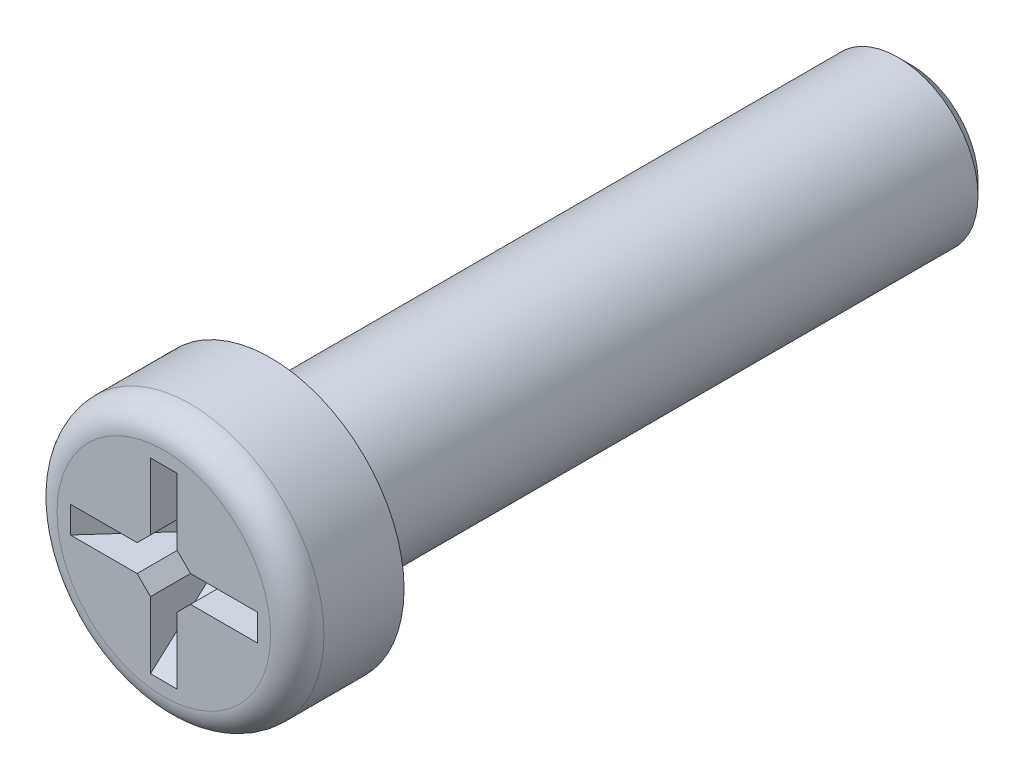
ISO-10303-21;
HEADER;
FILE_DESCRIPTION(('STEP AP214'),'2;1');
FILE_NAME('part.step','',(''),(''),'','','');
FILE_SCHEMA(('AUTOMOTIVE_DESIGN { 1 0 10303 214 1 1 1 1 }'));
ENDSEC;
DATA;
#1=APPLICATION_CONTEXT('core data for automotive mechanical design processes');
#2=APPLICATION_PROTOCOL_DEFINITION('international standard','automotive_design',2000,#1);
#3=PRODUCT_CONTEXT('',#1,'mechanical');
#4=PRODUCT('Part','Part','',(#3));
#5=PRODUCT_RELATED_PRODUCT_CATEGORY('part','',(#4));
#6=PRODUCT_DEFINITION_FORMATION('','',#4);
#7=PRODUCT_DEFINITION_CONTEXT('part definition',#1,'design');
#8=PRODUCT_DEFINITION('design','',#6,#7);
#9=PRODUCT_DEFINITION_SHAPE('','',#8);
#10=(LENGTH_UNIT() NAMED_UNIT(*) SI_UNIT(.MILLI.,.METRE.));
#11=(NAMED_UNIT(*) PLANE_ANGLE_UNIT() SI_UNIT($,.RADIAN.));
#12=(NAMED_UNIT(*) SI_UNIT($,.STERADIAN.) SOLID_ANGLE_UNIT());
#13=UNCERTAINTY_MEASURE_WITH_UNIT(LENGTH_MEASURE(1.E-05),#10,'distance_accuracy_value','');
#14=(GEOMETRIC_REPRESENTATION_CONTEXT(3) GLOBAL_UNCERTAINTY_ASSIGNED_CONTEXT((#13)) GLOBAL_UNIT_ASSIGNED_CONTEXT((#10,
#11,#12)) REPRESENTATION_CONTEXT('',''));
#15=CARTESIAN_POINT('',(0.,0.,0.));
#16=DIRECTION('',(0.,0.,1.));
#17=DIRECTION('',(1.,0.,0.));
#18=AXIS2_PLACEMENT_3D('',#15,#16,#17);
#19=CARTESIAN_POINT('',(1.75,0.25,2.));
#20=DIRECTION('',(-0.743144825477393,0.,0.669130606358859));
#21=DIRECTION('',(0.669130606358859,0.,0.743144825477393));
#22=AXIS2_PLACEMENT_3D('',#19,#20,#21);
#23=PLANE('',#22);
#24=DIRECTION('',(-0.669130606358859,0.,-0.743144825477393));
#25=VECTOR('',#24,1.);
#26=CARTESIAN_POINT('',(1.75,0.25,2.));
#27=LINE('',#26,#25);
#28=CARTESIAN_POINT('',(0.500000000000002,0.249999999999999,0.611734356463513));
#29=VERTEX_POINT('',#28);
#30=CARTESIAN_POINT('',(1.75,0.25,2.));
#31=VERTEX_POINT('',#30);
#32=EDGE_CURVE('E223',#29,#31,#27,.F.);
#33=ORIENTED_EDGE('',*,*,#32,.F.);
#34=DIRECTION('',(-0.556117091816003,0.556117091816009,-0.617630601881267));
#35=VECTOR('',#34,1.);
#36=CARTESIAN_POINT('',(1.36341722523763,-0.61341722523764,1.57065633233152));
#37=LINE('',#36,#35);
#38=CARTESIAN_POINT('',(0.375000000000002,0.375,0.472907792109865));
#39=VERTEX_POINT('',#38);
#40=EDGE_CURVE('E270',#29,#39,#37,.T.);
#41=ORIENTED_EDGE('',*,*,#40,.T.);
#42=DIRECTION('',(-0.556117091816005,-0.556117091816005,-0.617630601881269));
#43=VECTOR('',#42,1.);
#44=CARTESIAN_POINT('',(1.13146756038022,1.13146756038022,1.31305013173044));
#45=LINE('',#44,#43);
#46=CARTESIAN_POINT('',(0.0392323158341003,0.0392323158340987,0.1));
#47=VERTEX_POINT('',#46);
#48=EDGE_CURVE('E242',#39,#47,#45,.T.);
#49=ORIENTED_EDGE('',*,*,#48,.T.);
#50=DIRECTION('',(0.,-1.,0.));
#51=VECTOR('',#50,1.);
#52=CARTESIAN_POINT('',(0.0392323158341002,-0.249999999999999,0.1));
#53=LINE('',#52,#51);
#54=CARTESIAN_POINT('',(0.0392323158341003,-0.0392323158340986,0.1));
#55=VERTEX_POINT('',#54);
#56=EDGE_CURVE('E226',#55,#47,#53,.F.);
#57=ORIENTED_EDGE('',*,*,#56,.F.);
#58=DIRECTION('',(-0.556117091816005,0.556117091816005,-0.617630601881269));
#59=VECTOR('',#58,1.);
#60=CARTESIAN_POINT('',(1.13146756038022,-1.13146756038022,1.31305013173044));
#61=LINE('',#60,#59);
#62=CARTESIAN_POINT('',(0.375000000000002,-0.375,0.472907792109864));
#63=VERTEX_POINT('',#62);
#64=EDGE_CURVE('E57',#63,#55,#61,.T.);
#65=ORIENTED_EDGE('',*,*,#64,.F.);
#66=DIRECTION('',(0.556117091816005,0.556117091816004,0.617630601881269));
#67=VECTOR('',#66,1.);
#68=CARTESIAN_POINT('',(1.51805033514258,0.768050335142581,1.74239379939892));
#69=LINE('',#68,#67);
#70=CARTESIAN_POINT('',(0.500000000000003,-0.249999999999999,0.611734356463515));
#71=VERTEX_POINT('',#70);
#72=EDGE_CURVE('E281',#63,#71,#69,.T.);
#73=ORIENTED_EDGE('',*,*,#72,.T.);
#74=DIRECTION('',(-0.669130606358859,0.,-0.743144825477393));
#75=VECTOR('',#74,1.);
#76=CARTESIAN_POINT('',(0.133600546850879,-0.249999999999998,0.204806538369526));
#77=LINE('',#76,#75);
#78=CARTESIAN_POINT('',(1.75,-0.25,2.));
#79=VERTEX_POINT('',#78);
#80=EDGE_CURVE('E228',#71,#79,#77,.F.);
#81=ORIENTED_EDGE('',*,*,#80,.T.);
#82=DIRECTION('',(0.,1.,0.));
#83=VECTOR('',#82,1.);
#84=CARTESIAN_POINT('',(1.75,0.25,2.));
#85=LINE('',#84,#83);
#86=EDGE_CURVE('E190',#79,#31,#85,.T.);
#87=ORIENTED_EDGE('',*,*,#86,.T.);
#88=EDGE_LOOP('',(#33,#41,#49,#57,#65,#73,#81,#87));
#89=FACE_BOUND('',#88,.T.);
#90=ADVANCED_FACE('F34',(#89),#23,.T.);
#91=CARTESIAN_POINT('',(-0.250000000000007,1.75,2.));
#92=DIRECTION('',(0.,-0.743144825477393,0.669130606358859));
#93=DIRECTION('',(0.,-0.669130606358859,-0.743144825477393));
#94=AXIS2_PLACEMENT_3D('',#91,#92,#93);
#95=PLANE('',#94);
#96=ORIENTED_EDGE('',*,*,#48,.F.);
#97=DIRECTION('',(-0.556117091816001,0.556117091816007,0.61763060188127));
#98=VECTOR('',#97,1.);
#99=CARTESIAN_POINT('',(-0.768050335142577,1.51805033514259,1.74239379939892));
#100=LINE('',#99,#98);
#101=CARTESIAN_POINT('',(0.250000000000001,0.500000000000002,0.611734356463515));
#102=VERTEX_POINT('',#101);
#103=EDGE_CURVE('E273',#39,#102,#100,.T.);
#104=ORIENTED_EDGE('',*,*,#103,.T.);
#105=DIRECTION('',(0.,-0.669130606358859,-0.743144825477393));
#106=VECTOR('',#105,1.);
#107=CARTESIAN_POINT('',(0.250000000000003,0.80520419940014,0.950697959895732));
#108=LINE('',#107,#106);
#109=CARTESIAN_POINT('',(0.250000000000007,1.75,2.));
#110=VERTEX_POINT('',#109);
#111=EDGE_CURVE('E221',#102,#110,#108,.F.);
#112=ORIENTED_EDGE('',*,*,#111,.T.);
#113=DIRECTION('',(-1.,0.,0.));
#114=VECTOR('',#113,1.);
#115=CARTESIAN_POINT('',(-0.250000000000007,1.75,2.));
#116=LINE('',#115,#114);
#117=CARTESIAN_POINT('',(-0.250000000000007,1.75,2.));
#118=VERTEX_POINT('',#117);
#119=EDGE_CURVE('E199',#110,#118,#116,.T.);
#120=ORIENTED_EDGE('',*,*,#119,.T.);
#121=DIRECTION('',(0.,-0.669130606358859,-0.743144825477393));
#122=VECTOR('',#121,1.);
#123=CARTESIAN_POINT('',(-0.250000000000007,1.75,2.));
#124=LINE('',#123,#122);
#125=CARTESIAN_POINT('',(-0.250000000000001,0.5,0.611734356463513));
#126=VERTEX_POINT('',#125);
#127=EDGE_CURVE('E207',#126,#118,#124,.F.);
#128=ORIENTED_EDGE('',*,*,#127,.F.);
#129=DIRECTION('',(-0.556117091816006,-0.556117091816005,-0.617630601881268));
#130=VECTOR('',#129,1.);
#131=CARTESIAN_POINT('',(0.613417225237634,1.36341722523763,1.57065633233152));
#132=LINE('',#131,#130);
#133=CARTESIAN_POINT('',(-0.375000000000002,0.375,0.472907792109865));
#134=VERTEX_POINT('',#133);
#135=EDGE_CURVE('E275',#126,#134,#132,.T.);
#136=ORIENTED_EDGE('',*,*,#135,.T.);
#137=DIRECTION('',(0.556117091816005,-0.556117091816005,-0.617630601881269));
#138=VECTOR('',#137,1.);
#139=CARTESIAN_POINT('',(-1.28610067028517,1.28610067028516,1.48478759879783));
#140=LINE('',#139,#138);
#141=CARTESIAN_POINT('',(-0.0392323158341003,0.0392323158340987,0.1));
#142=VERTEX_POINT('',#141);
#143=EDGE_CURVE('E239',#134,#142,#140,.T.);
#144=ORIENTED_EDGE('',*,*,#143,.T.);
#145=DIRECTION('',(1.,0.,0.));
#146=VECTOR('',#145,1.);
#147=CARTESIAN_POINT('',(-0.249999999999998,0.0392323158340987,0.1));
#148=LINE('',#147,#146);
#149=EDGE_CURVE('E160',#47,#142,#148,.F.);
#150=ORIENTED_EDGE('',*,*,#149,.F.);
#151=EDGE_LOOP('',(#96,#104,#112,#120,#128,#136,#144,#150));
#152=FACE_BOUND('',#151,.T.);
#153=ADVANCED_FACE('F36',(#152),#95,.T.);
#154=CARTESIAN_POINT('',(-0.250000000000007,-1.75,2.));
#155=DIRECTION('',(0.,0.743144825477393,0.669130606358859));
#156=DIRECTION('',(0.,-0.669130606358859,0.743144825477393));
#157=AXIS2_PLACEMENT_3D('',#154,#155,#156);
#158=PLANE('',#157);
#159=DIRECTION('',(0.,0.669130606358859,-0.743144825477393));
#160=VECTOR('',#159,1.);
#161=CARTESIAN_POINT('',(0.250000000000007,-1.75,2.));
#162=LINE('',#161,#160);
#163=CARTESIAN_POINT('',(0.250000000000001,-0.5,0.611734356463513));
#164=VERTEX_POINT('',#163);
#165=CARTESIAN_POINT('',(0.250000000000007,-1.75,2.));
#166=VERTEX_POINT('',#165);
#167=EDGE_CURVE('E230',#164,#166,#162,.F.);
#168=ORIENTED_EDGE('',*,*,#167,.F.);
#169=DIRECTION('',(0.556117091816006,0.556117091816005,-0.617630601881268));
#170=VECTOR('',#169,1.);
#171=CARTESIAN_POINT('',(-0.768050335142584,-1.51805033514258,1.74239379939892));
#172=LINE('',#171,#170);
#173=EDGE_CURVE('E279',#164,#63,#172,.T.);
#174=ORIENTED_EDGE('',*,*,#173,.T.);
#175=ORIENTED_EDGE('',*,*,#64,.T.);
#176=DIRECTION('',(-1.,0.,0.));
#177=VECTOR('',#176,1.);
#178=CARTESIAN_POINT('',(-0.249999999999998,-0.0392323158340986,0.1));
#179=LINE('',#178,#177);
#180=CARTESIAN_POINT('',(-0.0392323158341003,-0.0392323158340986,0.1));
#181=VERTEX_POINT('',#180);
#182=EDGE_CURVE('E218',#181,#55,#179,.F.);
#183=ORIENTED_EDGE('',*,*,#182,.F.);
#184=DIRECTION('',(0.556117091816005,0.556117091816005,-0.617630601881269));
#185=VECTOR('',#184,1.);
#186=CARTESIAN_POINT('',(-1.28610067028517,-1.28610067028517,1.48478759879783));
#187=LINE('',#186,#185);
#188=CARTESIAN_POINT('',(-0.375000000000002,-0.375,0.472907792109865));
#189=VERTEX_POINT('',#188);
#190=EDGE_CURVE('E49',#189,#181,#187,.T.);
#191=ORIENTED_EDGE('',*,*,#190,.F.);
#192=DIRECTION('',(0.556117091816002,-0.556117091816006,0.61763060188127));
#193=VECTOR('',#192,1.);
#194=CARTESIAN_POINT('',(0.61341722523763,-1.36341722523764,1.57065633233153));
#195=LINE('',#194,#193);
#196=CARTESIAN_POINT('',(-0.250000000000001,-0.500000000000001,0.611734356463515));
#197=VERTEX_POINT('',#196);
#198=EDGE_CURVE('E285',#189,#197,#195,.T.);
#199=ORIENTED_EDGE('',*,*,#198,.T.);
#200=DIRECTION('',(0.,0.669130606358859,-0.743144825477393));
#201=VECTOR('',#200,1.);
#202=CARTESIAN_POINT('',(-0.25,-0.133600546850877,0.204806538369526));
#203=LINE('',#202,#201);
#204=CARTESIAN_POINT('',(-0.250000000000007,-1.75,2.));
#205=VERTEX_POINT('',#204);
#206=EDGE_CURVE('E220',#197,#205,#203,.F.);
#207=ORIENTED_EDGE('',*,*,#206,.T.);
#208=DIRECTION('',(1.,0.,0.));
#209=VECTOR('',#208,1.);
#210=CARTESIAN_POINT('',(-0.250000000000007,-1.75,2.));
#211=LINE('',#210,#209);
#212=EDGE_CURVE('E181',#205,#166,#211,.T.);
#213=ORIENTED_EDGE('',*,*,#212,.T.);
#214=EDGE_LOOP('',(#168,#174,#175,#183,#191,#199,#207,#213));
#215=FACE_BOUND('',#214,.T.);
#216=ADVANCED_FACE('F307',(#215),#158,.T.);
#217=CARTESIAN_POINT('',(-1.75,0.25,2.));
#218=DIRECTION('',(0.743144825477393,0.,0.669130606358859));
#219=DIRECTION('',(0.669130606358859,0.,-0.743144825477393));
#220=AXIS2_PLACEMENT_3D('',#217,#218,#219);
#221=PLANE('',#220);
#222=ORIENTED_EDGE('',*,*,#143,.F.);
#223=DIRECTION('',(-0.556117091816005,-0.556117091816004,0.617630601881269));
#224=VECTOR('',#223,1.);
#225=CARTESIAN_POINT('',(-1.36341722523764,-0.613417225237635,1.57065633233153));
#226=LINE('',#225,#224);
#227=CARTESIAN_POINT('',(-0.500000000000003,0.249999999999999,0.611734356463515));
#228=VERTEX_POINT('',#227);
#229=EDGE_CURVE('E155',#134,#228,#226,.T.);
#230=ORIENTED_EDGE('',*,*,#229,.T.);
#231=DIRECTION('',(0.669130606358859,0.,-0.743144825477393));
#232=VECTOR('',#231,1.);
#233=CARTESIAN_POINT('',(-0.805204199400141,0.249999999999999,0.950697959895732));
#234=LINE('',#233,#232);
#235=CARTESIAN_POINT('',(-1.75,0.25,2.));
#236=VERTEX_POINT('',#235);
#237=EDGE_CURVE('E147',#228,#236,#234,.F.);
#238=ORIENTED_EDGE('',*,*,#237,.T.);
#239=DIRECTION('',(0.,-1.,0.));
#240=VECTOR('',#239,1.);
#241=CARTESIAN_POINT('',(-1.75,0.25,2.));
#242=LINE('',#241,#240);
#243=CARTESIAN_POINT('',(-1.75,-0.25,2.));
#244=VERTEX_POINT('',#243);
#245=EDGE_CURVE('E152',#236,#244,#242,.T.);
#246=ORIENTED_EDGE('',*,*,#245,.T.);
#247=DIRECTION('',(0.669130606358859,0.,-0.743144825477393));
#248=VECTOR('',#247,1.);
#249=CARTESIAN_POINT('',(-1.75,-0.25,2.));
#250=LINE('',#249,#248);
#251=CARTESIAN_POINT('',(-0.500000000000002,-0.249999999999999,0.611734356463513));
#252=VERTEX_POINT('',#251);
#253=EDGE_CURVE('E159',#252,#244,#250,.F.);
#254=ORIENTED_EDGE('',*,*,#253,.F.);
#255=DIRECTION('',(0.556117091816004,-0.556117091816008,-0.617630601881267));
#256=VECTOR('',#255,1.);
#257=CARTESIAN_POINT('',(-1.51805033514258,0.768050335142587,1.74239379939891));
#258=LINE('',#257,#256);
#259=EDGE_CURVE('E283',#252,#189,#258,.T.);
#260=ORIENTED_EDGE('',*,*,#259,.T.);
#261=ORIENTED_EDGE('',*,*,#190,.T.);
#262=DIRECTION('',(0.,1.,0.));
#263=VECTOR('',#262,1.);
#264=CARTESIAN_POINT('',(-0.0392323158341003,-0.249999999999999,0.1));
#265=LINE('',#264,#263);
#266=EDGE_CURVE('E202',#142,#181,#265,.F.);
#267=ORIENTED_EDGE('',*,*,#266,.F.);
#268=EDGE_LOOP('',(#222,#230,#238,#246,#254,#260,#261,#267));
#269=FACE_BOUND('',#268,.T.);
#270=ADVANCED_FACE('F149',(#269),#221,.T.);
#271=CARTESIAN_POINT('',(0.,0.,0.));
#272=DIRECTION('',(0.,0.,1.));
#273=DIRECTION('',(1.,0.,0.));
#274=AXIS2_PLACEMENT_3D('',#271,#272,#273);
#275=PLANE('',#274);
#276=CARTESIAN_POINT('',(0.,0.,0.));
#277=DIRECTION('',(0.,0.,1.));
#278=DIRECTION('',(1.,0.,0.));
#279=AXIS2_PLACEMENT_3D('',#276,#277,#278);
#280=CIRCLE('',#279,2.5);
#281=CARTESIAN_POINT('',(2.5,0.,0.));
#282=VERTEX_POINT('',#281);
#283=EDGE_CURVE('E203',#282,#282,#280,.T.);
#284=ORIENTED_EDGE('',*,*,#283,.F.);
#285=EDGE_LOOP('',(#284));
#286=FACE_BOUND('',#285,.T.);
#287=CARTESIAN_POINT('',(0.,0.,0.));
#288=DIRECTION('',(0.,0.,1.));
#289=DIRECTION('',(1.,0.,0.));
#290=AXIS2_PLACEMENT_3D('',#287,#288,#289);
#291=CIRCLE('',#290,1.5);
#292=CARTESIAN_POINT('',(1.5,0.,0.));
#293=VERTEX_POINT('',#292);
#294=EDGE_CURVE('E206',#293,#293,#291,.F.);
#295=ORIENTED_EDGE('',*,*,#294,.F.);
#296=EDGE_LOOP('',(#295));
#297=FACE_BOUND('',#296,.T.);
#298=ADVANCED_FACE('F315',(#286,#297),#275,.F.);
#299=CARTESIAN_POINT('',(0.,0.,2.));
#300=DIRECTION('',(0.,0.,-1.));
#301=DIRECTION('',(-1.,0.,0.));
#302=AXIS2_PLACEMENT_3D('',#299,#300,#301);
#303=CYLINDRICAL_SURFACE('',#302,2.5);
#304=CARTESIAN_POINT('',(0.,0.,1.5));
#305=DIRECTION('',(0.,0.,1.));
#306=DIRECTION('',(1.,0.,0.));
#307=AXIS2_PLACEMENT_3D('',#304,#305,#306);
#308=CIRCLE('',#307,2.5);
#309=CARTESIAN_POINT('',(2.5,0.,1.5));
#310=VERTEX_POINT('',#309);
#311=EDGE_CURVE('E213',#310,#310,#308,.F.);
#312=ORIENTED_EDGE('',*,*,#311,.T.);
#313=EDGE_LOOP('',(#312));
#314=FACE_BOUND('',#313,.T.);
#315=ORIENTED_EDGE('',*,*,#283,.T.);
#316=EDGE_LOOP('',(#315));
#317=FACE_BOUND('',#316,.T.);
#318=ADVANCED_FACE('F316',(#314,#317),#303,.T.);
#319=CARTESIAN_POINT('',(0.,0.,2.));
#320=DIRECTION('',(0.,0.,1.));
#321=DIRECTION('',(1.,0.,0.));
#322=AXIS2_PLACEMENT_3D('',#319,#320,#321);
#323=PLANE('',#322);
#324=DIRECTION('',(0.,1.,0.));
#325=VECTOR('',#324,1.);
#326=CARTESIAN_POINT('',(0.250000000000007,1.75,2.));
#327=LINE('',#326,#325);
#328=CARTESIAN_POINT('',(0.250000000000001,0.500000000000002,2.));
#329=VERTEX_POINT('',#328);
#330=EDGE_CURVE('E196',#329,#110,#327,.T.);
#331=ORIENTED_EDGE('',*,*,#330,.F.);
#332=DIRECTION('',(-0.707106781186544,0.707106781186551,0.));
#333=VECTOR('',#332,1.);
#334=CARTESIAN_POINT('',(0.375000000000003,0.374999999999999,2.));
#335=LINE('',#334,#333);
#336=CARTESIAN_POINT('',(0.500000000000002,0.249999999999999,2.));
#337=VERTEX_POINT('',#336);
#338=EDGE_CURVE('E253',#329,#337,#335,.F.);
#339=ORIENTED_EDGE('',*,*,#338,.T.);
#340=DIRECTION('',(-1.,0.,0.));
#341=VECTOR('',#340,1.);
#342=CARTESIAN_POINT('',(0.25,0.249999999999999,2.));
#343=LINE('',#342,#341);
#344=EDGE_CURVE('E193',#31,#337,#343,.T.);
#345=ORIENTED_EDGE('',*,*,#344,.F.);
#346=ORIENTED_EDGE('',*,*,#86,.F.);
#347=DIRECTION('',(1.,0.,0.));
#348=VECTOR('',#347,1.);
#349=CARTESIAN_POINT('',(0.25,-0.249999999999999,2.));
#350=LINE('',#349,#348);
#351=CARTESIAN_POINT('',(0.500000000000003,-0.249999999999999,2.));
#352=VERTEX_POINT('',#351);
#353=EDGE_CURVE('E187',#352,#79,#350,.T.);
#354=ORIENTED_EDGE('',*,*,#353,.F.);
#355=DIRECTION('',(0.707106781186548,0.707106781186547,0.));
#356=VECTOR('',#355,1.);
#357=CARTESIAN_POINT('',(0.375,-0.375000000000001,2.));
#358=LINE('',#357,#356);
#359=CARTESIAN_POINT('',(0.250000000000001,-0.5,2.));
#360=VERTEX_POINT('',#359);
#361=EDGE_CURVE('E249',#352,#360,#358,.F.);
#362=ORIENTED_EDGE('',*,*,#361,.T.);
#363=DIRECTION('',(0.,1.,0.));
#364=VECTOR('',#363,1.);
#365=CARTESIAN_POINT('',(0.25,-0.249999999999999,2.));
#366=LINE('',#365,#364);
#367=EDGE_CURVE('E184',#166,#360,#366,.T.);
#368=ORIENTED_EDGE('',*,*,#367,.F.);
#369=ORIENTED_EDGE('',*,*,#212,.F.);
#370=DIRECTION('',(0.,-1.,0.));
#371=VECTOR('',#370,1.);
#372=CARTESIAN_POINT('',(-0.25,-0.249999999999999,2.));
#373=LINE('',#372,#371);
#374=CARTESIAN_POINT('',(-0.250000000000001,-0.500000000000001,2.));
#375=VERTEX_POINT('',#374);
#376=EDGE_CURVE('E175',#375,#205,#373,.T.);
#377=ORIENTED_EDGE('',*,*,#376,.F.);
#378=DIRECTION('',(0.707106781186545,-0.70710678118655,0.));
#379=VECTOR('',#378,1.);
#380=CARTESIAN_POINT('',(-0.375000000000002,-0.374999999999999,2.));
#381=LINE('',#380,#379);
#382=CARTESIAN_POINT('',(-0.500000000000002,-0.249999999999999,2.));
#383=VERTEX_POINT('',#382);
#384=EDGE_CURVE('E247',#375,#383,#381,.F.);
#385=ORIENTED_EDGE('',*,*,#384,.T.);
#386=DIRECTION('',(1.,0.,0.));
#387=VECTOR('',#386,1.);
#388=CARTESIAN_POINT('',(-1.75,-0.25,2.));
#389=LINE('',#388,#387);
#390=EDGE_CURVE('E173',#244,#383,#389,.T.);
#391=ORIENTED_EDGE('',*,*,#390,.F.);
#392=ORIENTED_EDGE('',*,*,#245,.F.);
#393=DIRECTION('',(-1.,0.,0.));
#394=VECTOR('',#393,1.);
#395=CARTESIAN_POINT('',(-1.75,0.25,2.));
#396=LINE('',#395,#394);
#397=CARTESIAN_POINT('',(-0.500000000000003,0.249999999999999,2.));
#398=VERTEX_POINT('',#397);
#399=EDGE_CURVE('E163',#398,#236,#396,.T.);
#400=ORIENTED_EDGE('',*,*,#399,.F.);
#401=DIRECTION('',(-0.707106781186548,-0.707106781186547,0.));
#402=VECTOR('',#401,1.);
#403=CARTESIAN_POINT('',(-0.375000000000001,0.375000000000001,2.));
#404=LINE('',#403,#402);
#405=CARTESIAN_POINT('',(-0.250000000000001,0.5,2.));
#406=VERTEX_POINT('',#405);
#407=EDGE_CURVE('E251',#398,#406,#404,.F.);
#408=ORIENTED_EDGE('',*,*,#407,.T.);
#409=DIRECTION('',(0.,-1.,0.));
#410=VECTOR('',#409,1.);
#411=CARTESIAN_POINT('',(-0.250000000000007,1.75,2.));
#412=LINE('',#411,#410);
#413=EDGE_CURVE('E167',#118,#406,#412,.T.);
#414=ORIENTED_EDGE('',*,*,#413,.F.);
#415=ORIENTED_EDGE('',*,*,#119,.F.);
#416=EDGE_LOOP('',(#331,#339,#345,#346,#354,#362,#368,#369,#377,#385,#391,#392,#400,#408,#414,#415));
#417=FACE_BOUND('',#416,.T.);
#418=CARTESIAN_POINT('',(0.,0.,2.));
#419=DIRECTION('',(0.,0.,1.));
#420=DIRECTION('',(1.,0.,0.));
#421=AXIS2_PLACEMENT_3D('',#418,#419,#420);
#422=CIRCLE('',#421,2.);
#423=CARTESIAN_POINT('',(2.,0.,2.));
#424=VERTEX_POINT('',#423);
#425=EDGE_CURVE('E210',#424,#424,#422,.T.);
#426=ORIENTED_EDGE('',*,*,#425,.T.);
#427=EDGE_LOOP('',(#426));
#428=FACE_BOUND('',#427,.T.);
#429=ADVANCED_FACE('F170',(#417,#428),#323,.T.);
#430=CARTESIAN_POINT('',(0.,0.,-12.));
#431=DIRECTION('',(0.,0.,1.));
#432=DIRECTION('',(1.,0.,0.));
#433=AXIS2_PLACEMENT_3D('',#430,#431,#432);
#434=CYLINDRICAL_SURFACE('',#433,1.5);
#435=CARTESIAN_POINT('',(0.,0.,-11.75));
#436=DIRECTION('',(0.,0.,-1.));
#437=DIRECTION('',(-1.,0.,0.));
#438=AXIS2_PLACEMENT_3D('',#435,#436,#437);
#439=CIRCLE('',#438,1.5);
#440=CARTESIAN_POINT('',(-1.5,0.,-11.75));
#441=VERTEX_POINT('',#440);
#442=EDGE_CURVE('E11',#441,#441,#439,.F.);
#443=ORIENTED_EDGE('',*,*,#442,.T.);
#444=EDGE_LOOP('',(#443));
#445=FACE_BOUND('',#444,.T.);
#446=ORIENTED_EDGE('',*,*,#294,.T.);
#447=EDGE_LOOP('',(#446));
#448=FACE_BOUND('',#447,.T.);
#449=ADVANCED_FACE('F322',(#445,#448),#434,.T.);
#450=CARTESIAN_POINT('',(0.,0.,-12.));
#451=DIRECTION('',(0.,0.,-1.));
#452=DIRECTION('',(-1.,0.,0.));
#453=AXIS2_PLACEMENT_3D('',#450,#451,#452);
#454=PLANE('',#453);
#455=CARTESIAN_POINT('',(0.,0.,-12.));
#456=DIRECTION('',(0.,0.,-1.));
#457=DIRECTION('',(-1.,0.,0.));
#458=AXIS2_PLACEMENT_3D('',#455,#456,#457);
#459=CIRCLE('',#458,1.25);
#460=CARTESIAN_POINT('',(-1.25,0.,-12.));
#461=VERTEX_POINT('',#460);
#462=EDGE_CURVE('E42',#461,#461,#459,.T.);
#463=ORIENTED_EDGE('',*,*,#462,.T.);
#464=EDGE_LOOP('',(#463));
#465=FACE_BOUND('',#464,.T.);
#466=ADVANCED_FACE('F289',(#465),#454,.T.);
#467=CARTESIAN_POINT('',(0.,0.,1.5));
#468=DIRECTION('',(0.,0.,1.));
#469=DIRECTION('',(1.,0.,0.));
#470=AXIS2_PLACEMENT_3D('',#467,#468,#469);
#471=TOROIDAL_SURFACE('',#470,2.,0.5);
#472=ORIENTED_EDGE('',*,*,#311,.F.);
#473=EDGE_LOOP('',(#472));
#474=FACE_BOUND('',#473,.T.);
#475=ORIENTED_EDGE('',*,*,#425,.F.);
#476=EDGE_LOOP('',(#475));
#477=FACE_BOUND('',#476,.T.);
#478=ADVANCED_FACE('F331',(#474,#477),#471,.T.);
#479=CARTESIAN_POINT('',(-0.250000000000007,1.75,0.1));
#480=DIRECTION('',(-1.,0.,0.));
#481=DIRECTION('',(0.,-1.,0.));
#482=AXIS2_PLACEMENT_3D('',#479,#480,#481);
#483=PLANE('',#482);
#484=ORIENTED_EDGE('',*,*,#413,.T.);
#485=DIRECTION('',(0.,0.,-1.));
#486=VECTOR('',#485,1.);
#487=CARTESIAN_POINT('',(-0.250000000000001,0.5,0.1));
#488=LINE('',#487,#486);
#489=EDGE_CURVE('E258',#406,#126,#488,.T.);
#490=ORIENTED_EDGE('',*,*,#489,.T.);
#491=ORIENTED_EDGE('',*,*,#127,.T.);
#492=EDGE_LOOP('',(#484,#490,#491));
#493=FACE_BOUND('',#492,.T.);
#494=ADVANCED_FACE('F334',(#493),#483,.F.);
#495=CARTESIAN_POINT('',(0.250000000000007,1.75,0.1));
#496=DIRECTION('',(1.,0.,0.));
#497=DIRECTION('',(0.,1.,0.));
#498=AXIS2_PLACEMENT_3D('',#495,#496,#497);
#499=PLANE('',#498);
#500=ORIENTED_EDGE('',*,*,#111,.F.);
#501=DIRECTION('',(0.,0.,1.));
#502=VECTOR('',#501,1.);
#503=CARTESIAN_POINT('',(0.250000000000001,0.500000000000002,0.1));
#504=LINE('',#503,#502);
#505=EDGE_CURVE('E244',#102,#329,#504,.T.);
#506=ORIENTED_EDGE('',*,*,#505,.T.);
#507=ORIENTED_EDGE('',*,*,#330,.T.);
#508=EDGE_LOOP('',(#500,#506,#507));
#509=FACE_BOUND('',#508,.T.);
#510=ADVANCED_FACE('F338',(#509),#499,.F.);
#511=CARTESIAN_POINT('',(0.25,0.249999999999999,0.1));
#512=DIRECTION('',(0.,1.,0.));
#513=DIRECTION('',(-1.,0.,0.));
#514=AXIS2_PLACEMENT_3D('',#511,#512,#513);
#515=PLANE('',#514);
#516=ORIENTED_EDGE('',*,*,#344,.T.);
#517=DIRECTION('',(0.,0.,-1.));
#518=VECTOR('',#517,1.);
#519=CARTESIAN_POINT('',(0.500000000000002,0.249999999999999,0.1));
#520=LINE('',#519,#518);
#521=EDGE_CURVE('E255',#337,#29,#520,.T.);
#522=ORIENTED_EDGE('',*,*,#521,.T.);
#523=ORIENTED_EDGE('',*,*,#32,.T.);
#524=EDGE_LOOP('',(#516,#522,#523));
#525=FACE_BOUND('',#524,.T.);
#526=ADVANCED_FACE('F358',(#525),#515,.F.);
#527=CARTESIAN_POINT('',(0.25,-0.249999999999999,0.1));
#528=DIRECTION('',(0.,-1.,0.));
#529=DIRECTION('',(1.,0.,0.));
#530=AXIS2_PLACEMENT_3D('',#527,#528,#529);
#531=PLANE('',#530);
#532=ORIENTED_EDGE('',*,*,#80,.F.);
#533=DIRECTION('',(0.,0.,1.));
#534=VECTOR('',#533,1.);
#535=CARTESIAN_POINT('',(0.500000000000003,-0.249999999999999,0.1));
#536=LINE('',#535,#534);
#537=EDGE_CURVE('E260',#71,#352,#536,.T.);
#538=ORIENTED_EDGE('',*,*,#537,.T.);
#539=ORIENTED_EDGE('',*,*,#353,.T.);
#540=EDGE_LOOP('',(#532,#538,#539));
#541=FACE_BOUND('',#540,.T.);
#542=ADVANCED_FACE('F354',(#541),#531,.F.);
#543=CARTESIAN_POINT('',(0.25,-0.249999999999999,0.1));
#544=DIRECTION('',(1.,0.,0.));
#545=DIRECTION('',(0.,1.,0.));
#546=AXIS2_PLACEMENT_3D('',#543,#544,#545);
#547=PLANE('',#546);
#548=ORIENTED_EDGE('',*,*,#367,.T.);
#549=DIRECTION('',(0.,0.,-1.));
#550=VECTOR('',#549,1.);
#551=CARTESIAN_POINT('',(0.250000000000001,-0.5,0.1));
#552=LINE('',#551,#550);
#553=EDGE_CURVE('E263',#360,#164,#552,.T.);
#554=ORIENTED_EDGE('',*,*,#553,.T.);
#555=ORIENTED_EDGE('',*,*,#167,.T.);
#556=EDGE_LOOP('',(#548,#554,#555));
#557=FACE_BOUND('',#556,.T.);
#558=ADVANCED_FACE('F350',(#557),#547,.F.);
#559=CARTESIAN_POINT('',(-0.25,-0.249999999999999,0.1));
#560=DIRECTION('',(-1.,0.,0.));
#561=DIRECTION('',(0.,-1.,0.));
#562=AXIS2_PLACEMENT_3D('',#559,#560,#561);
#563=PLANE('',#562);
#564=ORIENTED_EDGE('',*,*,#206,.F.);
#565=DIRECTION('',(0.,0.,1.));
#566=VECTOR('',#565,1.);
#567=CARTESIAN_POINT('',(-0.250000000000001,-0.500000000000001,0.1));
#568=LINE('',#567,#566);
#569=EDGE_CURVE('E265',#197,#375,#568,.T.);
#570=ORIENTED_EDGE('',*,*,#569,.T.);
#571=ORIENTED_EDGE('',*,*,#376,.T.);
#572=EDGE_LOOP('',(#564,#570,#571));
#573=FACE_BOUND('',#572,.T.);
#574=ADVANCED_FACE('F346',(#573),#563,.F.);
#575=CARTESIAN_POINT('',(-1.75,-0.25,0.1));
#576=DIRECTION('',(0.,-1.,0.));
#577=DIRECTION('',(1.,0.,0.));
#578=AXIS2_PLACEMENT_3D('',#575,#576,#577);
#579=PLANE('',#578);
#580=ORIENTED_EDGE('',*,*,#390,.T.);
#581=DIRECTION('',(0.,0.,-1.));
#582=VECTOR('',#581,1.);
#583=CARTESIAN_POINT('',(-0.500000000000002,-0.249999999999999,0.1));
#584=LINE('',#583,#582);
#585=EDGE_CURVE('E268',#383,#252,#584,.T.);
#586=ORIENTED_EDGE('',*,*,#585,.T.);
#587=ORIENTED_EDGE('',*,*,#253,.T.);
#588=EDGE_LOOP('',(#580,#586,#587));
#589=FACE_BOUND('',#588,.T.);
#590=ADVANCED_FACE('F343',(#589),#579,.F.);
#591=CARTESIAN_POINT('',(-1.75,0.25,0.1));
#592=DIRECTION('',(0.,1.,0.));
#593=DIRECTION('',(-1.,0.,0.));
#594=AXIS2_PLACEMENT_3D('',#591,#592,#593);
#595=PLANE('',#594);
#596=ORIENTED_EDGE('',*,*,#237,.F.);
#597=DIRECTION('',(0.,0.,1.));
#598=VECTOR('',#597,1.);
#599=CARTESIAN_POINT('',(-0.500000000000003,0.249999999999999,0.1));
#600=LINE('',#599,#598);
#601=EDGE_CURVE('E165',#228,#398,#600,.T.);
#602=ORIENTED_EDGE('',*,*,#601,.T.);
#603=ORIENTED_EDGE('',*,*,#399,.T.);
#604=EDGE_LOOP('',(#596,#602,#603));
#605=FACE_BOUND('',#604,.T.);
#606=ADVANCED_FACE('F164',(#605),#595,.F.);
#607=CARTESIAN_POINT('',(-0.249999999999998,-0.249999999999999,0.1));
#608=DIRECTION('',(0.,0.,1.));
#609=DIRECTION('',(1.,0.,0.));
#610=AXIS2_PLACEMENT_3D('',#607,#608,#609);
#611=PLANE('',#610);
#612=ORIENTED_EDGE('',*,*,#149,.T.);
#613=ORIENTED_EDGE('',*,*,#266,.T.);
#614=ORIENTED_EDGE('',*,*,#182,.T.);
#615=ORIENTED_EDGE('',*,*,#56,.T.);
#616=EDGE_LOOP('',(#612,#613,#614,#615));
#617=FACE_BOUND('',#616,.T.);
#618=ADVANCED_FACE('F342',(#617),#611,.T.);
#619=CARTESIAN_POINT('',(0.250000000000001,0.500000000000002,0.1));
#620=DIRECTION('',(0.707106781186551,0.707106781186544,0.));
#621=DIRECTION('',(-0.707106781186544,0.707106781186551,0.));
#622=AXIS2_PLACEMENT_3D('',#619,#620,#621);
#623=PLANE('',#622);
#624=ORIENTED_EDGE('',*,*,#40,.F.);
#625=ORIENTED_EDGE('',*,*,#521,.F.);
#626=ORIENTED_EDGE('',*,*,#338,.F.);
#627=ORIENTED_EDGE('',*,*,#505,.F.);
#628=ORIENTED_EDGE('',*,*,#103,.F.);
#629=EDGE_LOOP('',(#624,#625,#626,#627,#628));
#630=FACE_BOUND('',#629,.T.);
#631=ADVANCED_FACE('F368',(#630),#623,.F.);
#632=CARTESIAN_POINT('',(-0.500000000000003,0.249999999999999,0.1));
#633=DIRECTION('',(-0.707106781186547,0.707106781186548,0.));
#634=DIRECTION('',(-0.707106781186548,-0.707106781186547,0.));
#635=AXIS2_PLACEMENT_3D('',#632,#633,#634);
#636=PLANE('',#635);
#637=ORIENTED_EDGE('',*,*,#135,.F.);
#638=ORIENTED_EDGE('',*,*,#489,.F.);
#639=ORIENTED_EDGE('',*,*,#407,.F.);
#640=ORIENTED_EDGE('',*,*,#601,.F.);
#641=ORIENTED_EDGE('',*,*,#229,.F.);
#642=EDGE_LOOP('',(#637,#638,#639,#640,#641));
#643=FACE_BOUND('',#642,.T.);
#644=ADVANCED_FACE('F372',(#643),#636,.F.);
#645=CARTESIAN_POINT('',(0.500000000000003,-0.249999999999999,0.1));
#646=DIRECTION('',(0.707106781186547,-0.707106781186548,0.));
#647=DIRECTION('',(0.707106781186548,0.707106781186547,0.));
#648=AXIS2_PLACEMENT_3D('',#645,#646,#647);
#649=PLANE('',#648);
#650=ORIENTED_EDGE('',*,*,#173,.F.);
#651=ORIENTED_EDGE('',*,*,#553,.F.);
#652=ORIENTED_EDGE('',*,*,#361,.F.);
#653=ORIENTED_EDGE('',*,*,#537,.F.);
#654=ORIENTED_EDGE('',*,*,#72,.F.);
#655=EDGE_LOOP('',(#650,#651,#652,#653,#654));
#656=FACE_BOUND('',#655,.T.);
#657=ADVANCED_FACE('F299',(#656),#649,.F.);
#658=CARTESIAN_POINT('',(-0.250000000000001,-0.500000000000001,0.1));
#659=DIRECTION('',(-0.70710678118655,-0.707106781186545,0.));
#660=DIRECTION('',(0.707106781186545,-0.70710678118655,0.));
#661=AXIS2_PLACEMENT_3D('',#658,#659,#660);
#662=PLANE('',#661);
#663=ORIENTED_EDGE('',*,*,#259,.F.);
#664=ORIENTED_EDGE('',*,*,#585,.F.);
#665=ORIENTED_EDGE('',*,*,#384,.F.);
#666=ORIENTED_EDGE('',*,*,#569,.F.);
#667=ORIENTED_EDGE('',*,*,#198,.F.);
#668=EDGE_LOOP('',(#663,#664,#665,#666,#667));
#669=FACE_BOUND('',#668,.T.);
#670=ADVANCED_FACE('F293',(#669),#662,.F.);
#671=CARTESIAN_POINT('',(0.,0.,-12.));
#672=DIRECTION('',(0.,0.,1.));
#673=DIRECTION('',(1.,0.,0.));
#674=AXIS2_PLACEMENT_3D('',#671,#672,#673);
#675=CONICAL_SURFACE('',#674,1.25,0.785398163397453);
#676=ORIENTED_EDGE('',*,*,#442,.F.);
#677=EDGE_LOOP('',(#676));
#678=FACE_BOUND('',#677,.T.);
#679=ORIENTED_EDGE('',*,*,#462,.F.);
#680=EDGE_LOOP('',(#679));
#681=FACE_BOUND('',#680,.T.);
#682=ADVANCED_FACE('F291',(#678,#681),#675,.T.);
#683=CLOSED_SHELL('',(#90,#153,#216,#270,#298,#318,#429,#449,#466,#478,#494,#510,#526,#542,#558,
#574,#590,#606,#618,#631,#644,#657,#670,#682));
#684=MANIFOLD_SOLID_BREP('B2',#683);
#685=ADVANCED_BREP_SHAPE_REPRESENTATION('',(#18,#684),#14);
#686=SHAPE_DEFINITION_REPRESENTATION(#9,#685);
ENDSEC;
END-ISO-10303-21;
